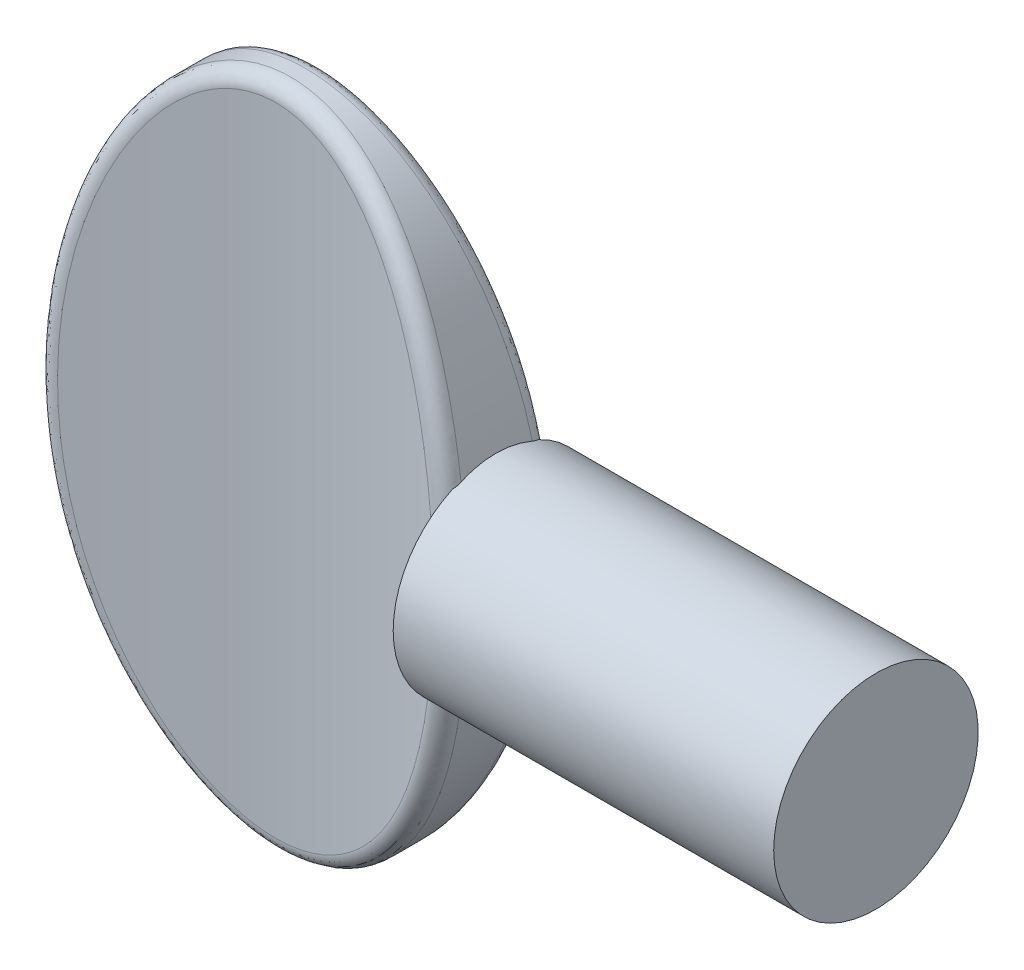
from build123d import *

# Parameters (mm, degrees)
SKETCH1_RX              = 5.715
SKETCH1_RY              = 3.556
EXTRUDE1_DEPTH          = 1.016
CUT_EXTRUDE1_DEPTH      = 7.8072473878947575
CUT_EXTRUDE1_DEPTH_BACK = 7.8072473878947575
SKETCH2_OUTSIDE_W       = 11.834000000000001
SKETCH2_OUTSIDE_H       = 6.754
FILLET3_R               = 0.254


with BuildPart() as part:
    # Sketch1 → Extrude1 (new, symmetric)
    with BuildSketch(Plane.XY):
        with Locations(Location((0, 0), (0, 0, -90))):
            Ellipse(SKETCH1_RX, SKETCH1_RY)
    extrude(amount=EXTRUDE1_DEPTH, both=True)

    # Sketch2 outside → Cut-Extrude1 (cut, two sides: drawn at the far end of the back side and taken through both)
    with BuildSketch(Plane(origin=(0, 0, 0), x_dir=(1, 0, 0), z_dir=(0, 1, 0)).offset(-CUT_EXTRUDE1_DEPTH_BACK)):
        Rectangle(SKETCH2_OUTSIDE_W, SKETCH2_OUTSIDE_H)
        with BuildLine():
            Line((-3.556, 1.016), (-3.556, -1.016))
            ThreePointArc((-3.556, -1.016), (6.3e-16, -0.3810000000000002), (3.556, -1.016))
            Line((3.556, -1.016), (3.556, 1.016))
            ThreePointArc((3.556, 1.016), (6.3e-16, 0.3810000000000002), (-3.556, 1.016))
        make_face(mode=Mode.SUBTRACT)
    extrude(amount=CUT_EXTRUDE1_DEPTH + CUT_EXTRUDE1_DEPTH_BACK, mode=Mode.SUBTRACT)

    # Fillet3
    fillet3_edges = [part.edges().sort_by_distance(p)[0] for p in [
        (-2.772297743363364, -3.579097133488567, 0.7620899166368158),
        (6.761380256e-08, 5.714999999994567, -0.38099999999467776),
    ]]
    fillet(fillet3_edges, radius=FILLET3_R)

    # Sketch3 → Revolve1 (revolve)
    with BuildSketch(Plane(origin=(0, 0, 0), x_dir=(1, 0, 0), z_dir=(0, 1, 0)), mode=Mode.PRIVATE) as revolve1_sk:
        with BuildLine():
            Line((4.741333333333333, 1.7526), (9.906, 1.7526))
            Line((9.906, 1.7526), (9.906, 0))
            Line((9.906, 0), (2.577464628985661, 1e-17))
            Line((2.577464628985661, 1e-17), (2.577464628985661, 0.7095513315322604))
            ThreePointArc((2.577464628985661, 0.7095513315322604), (3.1592934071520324, 1.093146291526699), (3.3846611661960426, 1.7526000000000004))
            Line((3.3846611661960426, 1.7526000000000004), (4.741333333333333, 1.7526))
        make_face()
    revolve(revolve1_sk.sketch.rotate(Axis((0, 0, 0), (1, 0, 0)), 180), axis=Axis((0, 0, 0), (1, 0, 0)))


solid = part.part
